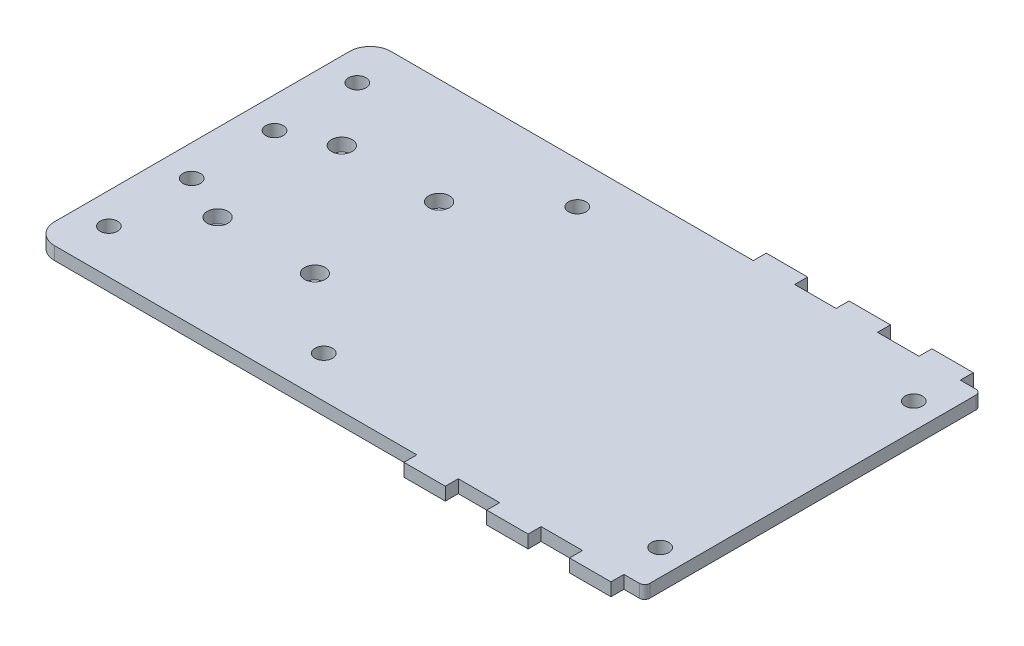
from build123d import *

# Parameters (mm, degrees)
SKETCH1_W                     = 10.16
SKETCH1_H                     = 3.175
MAIN_EXTRUDE_DEPTH            = 3.175
SKETCH2_R                     = 2.54
CASTER_MOUNTING_HOLES_DEPTH   = 89.274136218
SKETCH3_W                     = 2.54
SKETCH3_H                     = 82.55
REMOVE_UNEVEN_BACK_EDGE_DEPTH = 89.274136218
SKETCH5_R                     = 2.15
STANDOFF_HOLES_DEPTH          = 89.274136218
FILLET1_R                     = 5.08
FILLET2_R                     = 1.27
FILLET3_R                     = 1.27
SKETCH9_R                     = 2.15
FRONT_MOUNTING_HOLES_DEPTH    = 89.274136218


with BuildPart() as part:
    # Sketch1 → Main Extrude (new body)
    with BuildSketch(Plane(origin=(0, 0, 0), x_dir=(1, 0, 0), z_dir=(0, 1, 0))):
        with Locations((22.86, -42.8625)):
            Rectangle(SKETCH1_W, SKETCH1_H)
        Polygon((27.94, -41.275), (38.1, -41.275), (48.26, -41.275), (58.42, -41.275), (68.58, -41.275), (76.2, -41.275), (76.2, 41.275), (68.58, 41.275), (58.42, 41.275), (48.26, 41.275), (38.1, 41.275), (27.94, 41.275), (17.78, 41.275), (-76.2, 41.275), (-76.2, -41.275), (17.78, -41.275), align=None)
        with Locations((43.18, -42.8625)):
            Rectangle(SKETCH1_W, SKETCH1_H)
        with Locations((22.86, 42.8625)):
            Rectangle(SKETCH1_W, SKETCH1_H)
        with Locations((63.5, -42.8625)):
            Rectangle(SKETCH1_W, SKETCH1_H)
        with Locations((63.5, 42.8625)):
            Rectangle(SKETCH1_W, SKETCH1_H)
        with Locations((43.18, 42.8625)):
            Rectangle(SKETCH1_W, SKETCH1_H)
    extrude(amount=MAIN_EXTRUDE_DEPTH)

    # Sketch2 → Caster Mounting Holes (cut, through all)
    with BuildSketch(Plane(origin=(0, 3.175, 0), x_dir=(1, 0, 0), z_dir=(0, 1, 0))):
        with Locations(Location((-57.15, 15.24, 0), (0, 0, 270))):
            Circle(SKETCH2_R)
        with Locations(Location((-33.274, 15.24, 0), (0, 0, 270))):
            Circle(SKETCH2_R)
        with Locations(Location((-33.274, -15.24, 0), (0, 0, 270))):
            Circle(SKETCH2_R)
        with Locations(Location((-57.15, -15.24, 0), (0, 0, 270))):
            Circle(SKETCH2_R)
    extrude(amount=-CASTER_MOUNTING_HOLES_DEPTH, mode=Mode.SUBTRACT)

    # Sketch3 → Remove Uneven Back Edge (cut, through all)
    with BuildSketch(Plane(origin=(0, 3.175, 0), x_dir=(1, 0, 0), z_dir=(0, 1, 0))):
        with Locations((74.93, 0)):
            Rectangle(SKETCH3_W, SKETCH3_H)
    extrude(amount=-REMOVE_UNEVEN_BACK_EDGE_DEPTH, mode=Mode.SUBTRACT)

    # Sketch5 → Standoff Holes (cut, through all)
    with BuildSketch(Plane(origin=(0, 3.175, 0), x_dir=(1, 0, 0), z_dir=(0, 1, 0))):
        with Locations(Location((-15.24, 31.115, 0), (0, 0, 270))):
            Circle(SKETCH5_R)
        with Locations(Location((67.31, 31.115, 0), (0, 0, 270))):
            Circle(SKETCH5_R)
        with Locations(Location((67.31, -31.115, 0), (0, 0, 270))):
            Circle(SKETCH5_R)
        with Locations(Location((-15.24, -31.115, 0), (0, 0, 270))):
            Circle(SKETCH5_R)
    extrude(amount=-STANDOFF_HOLES_DEPTH, mode=Mode.SUBTRACT)

    # Fillet1
    fillet1_edges = [part.edges().sort_by_distance(p)[0] for p in [
        (-76.2, 1.5875, 41.275),
        (-76.2, 1.5875, -41.275),
    ]]
    fillet(fillet1_edges, radius=FILLET1_R)

    # Fillet2
    fillet2_edges = [part.edges().sort_by_distance(p)[0] for p in [
        (73.66, 1.5875, 41.275),
    ]]
    fillet(fillet2_edges, radius=FILLET2_R)

    # Fillet3
    fillet3_edges = [part.edges().sort_by_distance(p)[0] for p in [
        (73.66, 1.5875, -41.275),
    ]]
    fillet(fillet3_edges, radius=FILLET3_R)

    # Sketch9 → Front Mounting Holes (cut, through all)
    with BuildSketch(Plane(origin=(0, 3.175, 0), x_dir=(1, 0, 0), z_dir=(0, 1, 0))):
        with Locations(Location((-68.58, -30.48, 0), (0, 0, 270))):
            Circle(SKETCH9_R)
        with Locations(Location((-68.58, -10.16, 0), (0, 0, 270))):
            Circle(SKETCH9_R)
        with Locations(Location((-68.58, 10.16, 0), (0, 0, 270))):
            Circle(SKETCH9_R)
        with Locations(Location((-68.58, 30.48, 0), (0, 0, 270))):
            Circle(SKETCH9_R)
    extrude(amount=-FRONT_MOUNTING_HOLES_DEPTH, mode=Mode.SUBTRACT)


solid = part.part
